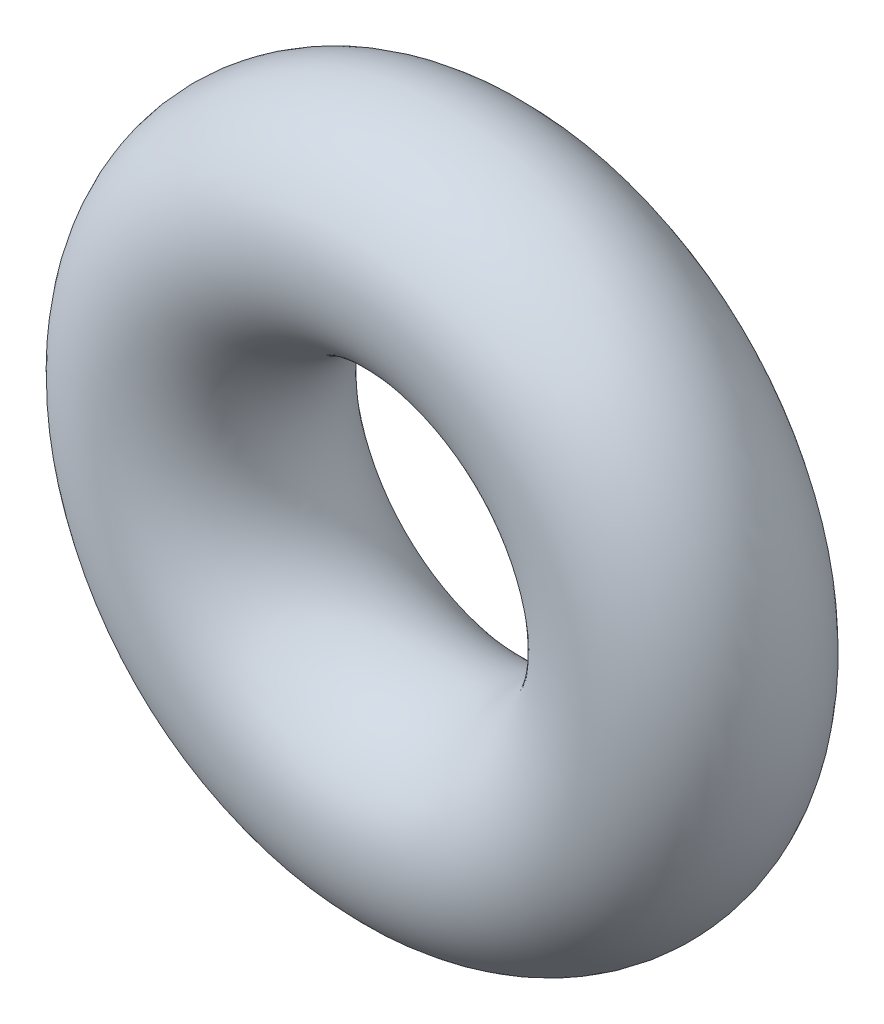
from build123d import *

# Parameters (mm, degrees)
ESQUISSE2_R = 5


with BuildPart() as part:
    # Esquisse2 → R_volution1 (revolve)
    with BuildSketch(Plane(origin=(0, 0, 0), x_dir=(1, 0, 0), z_dir=(0, 1, 0)), mode=Mode.PRIVATE) as r_volution1_sk:
        with Locations((11, -5)):
            Circle(ESQUISSE2_R)
    revolve(r_volution1_sk.sketch.rotate(Axis((0, 0, 0), (0, 0, 1)), 180), axis=Axis((0, 0, 0), (0, 0, 1)))


solid = part.part
